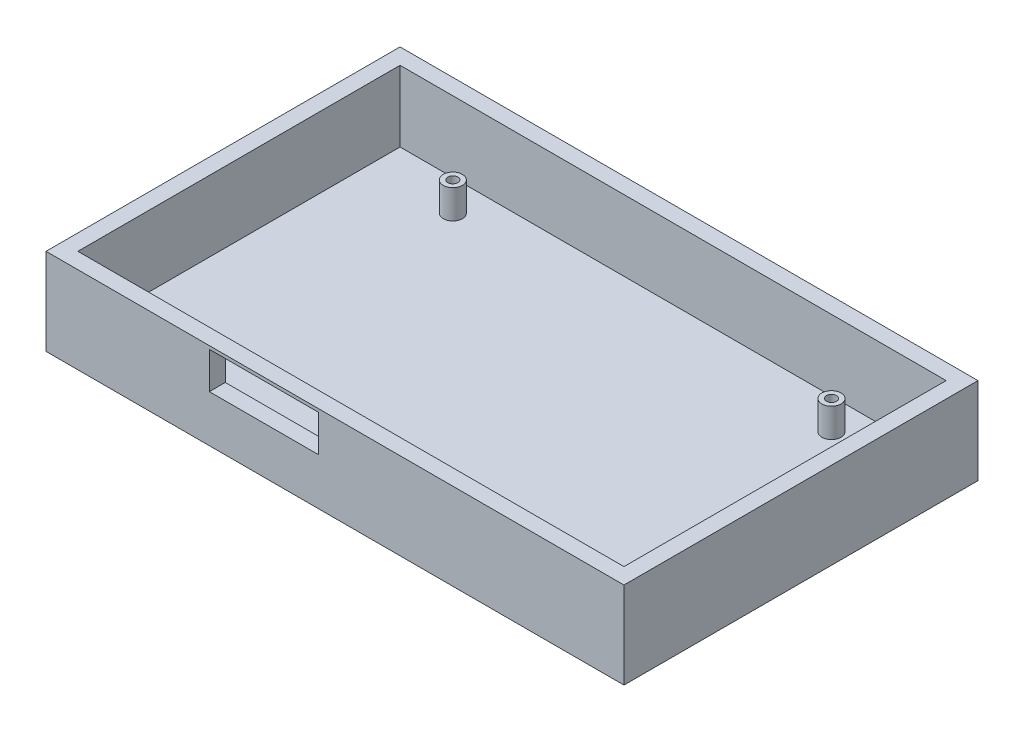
from build123d import *

# Parameters (mm, degrees)
SKETCH1_W                       = 127
SKETCH1_H                       = 77.796898
BOSS_EXTRUDE1_DEPTH             = 19.05
SHELL1_T                        = -3.5
SKETCH2_R                       = 2.1
BOSS_EXTRUDE2_DEPTH             = 6.35
F_44_0_086_DIAMETER_HOLE1_D     = 2.1844
F_44_0_086_DIAMETER_HOLE1_DEPTH = 3.81
F_44_0_086_DIAMETER_HOLE1_TIP   = 0.656259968
F_44_0_086_DIAMETER_HOLE2_D     = 2.1844
F_44_0_086_DIAMETER_HOLE2_DEPTH = 3.81
F_44_0_086_DIAMETER_HOLE2_TIP   = 0.656259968
F_44_0_086_DIAMETER_HOLE3_D     = 2.1844
F_44_0_086_DIAMETER_HOLE3_DEPTH = 3.81
F_44_0_086_DIAMETER_HOLE3_TIP   = 0.656259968
F_44_0_086_DIAMETER_HOLE4_D     = 2.1844
F_44_0_086_DIAMETER_HOLE4_DEPTH = 3.81
F_44_0_086_DIAMETER_HOLE4_TIP   = 0.656259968
CUT_EXTRUDE1_DEPTH              = 2.5
CUT_EXTRUDE2_REACH              = 113.922
SKETCH10_W                      = 24
SKETCH10_H                      = 8.062185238


with BuildPart() as part:
    # Sketch1 → Boss-Extrude1 (new body)
    with BuildSketch(Plane(origin=(0, 0, 0), x_dir=(1, 0, 0), z_dir=(0, 1, 0))):
        with Locations((14.675103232, -10.655753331)):
            Rectangle(SKETCH1_W, SKETCH1_H)
    extrude(amount=BOSS_EXTRUDE1_DEPTH)

    # Shell1
    shell1_openings = [part.faces().sort_by_distance(p)[0] for p in [
        (14.675103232, 19.05, 10.655753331),
    ]]
    offset(amount=SHELL1_T, openings=shell1_openings, kind=Kind.INTERSECTION)

    # Sketch2 → Boss-Extrude2 (add)
    with BuildSketch(Plane(origin=(0, 3.5, 0), x_dir=(1, 0, 0), z_dir=(0, 1, 0))):
        with Locations(Location((56.275203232, -39.257604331, 0), (0, 0, 270))):
            Circle(SKETCH2_R)
        with Locations(Location((-26.924996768, -39.257604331, 0), (0, 0, 270))):
            Circle(SKETCH2_R)
        with Locations(Location((-26.924996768, 17.942695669, 0), (0, 0, 270))):
            Circle(SKETCH2_R)
        with Locations(Location((56.275203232, 17.942695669, 0), (0, 0, 270))):
            Circle(SKETCH2_R)
    extrude(amount=BOSS_EXTRUDE2_DEPTH)

    # 44 _0.086_ Diameter Hole1
    with Locations(Plane(origin=(56.275203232, 9.85, 39.257604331), x_dir=(0, 0, 1), z_dir=(0, 1, 0))):
        with Locations((0, 0)):
            Hole(F_44_0_086_DIAMETER_HOLE1_D / 2, depth=F_44_0_086_DIAMETER_HOLE1_DEPTH)
            with Locations((0, 0, -(F_44_0_086_DIAMETER_HOLE1_DEPTH + F_44_0_086_DIAMETER_HOLE1_TIP / 2))):  # 118° drill point
                Cone(0, F_44_0_086_DIAMETER_HOLE1_D / 2, F_44_0_086_DIAMETER_HOLE1_TIP, mode=Mode.SUBTRACT)

    # 44 _0.086_ Diameter Hole2
    with Locations(Plane(origin=(-26.924996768, 9.85, 39.257604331), x_dir=(0, 0, 1), z_dir=(0, 1, 0))):
        with Locations((0, 0)):
            Hole(F_44_0_086_DIAMETER_HOLE2_D / 2, depth=F_44_0_086_DIAMETER_HOLE2_DEPTH)
            with Locations((0, 0, -(F_44_0_086_DIAMETER_HOLE2_DEPTH + F_44_0_086_DIAMETER_HOLE2_TIP / 2))):  # 118° drill point
                Cone(0, F_44_0_086_DIAMETER_HOLE2_D / 2, F_44_0_086_DIAMETER_HOLE2_TIP, mode=Mode.SUBTRACT)

    # 44 _0.086_ Diameter Hole3
    with Locations(Plane(origin=(-26.924996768, 9.85, -17.942695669), x_dir=(0, 0, 1), z_dir=(0, 1, 0))):
        with Locations((0, 0)):
            Hole(F_44_0_086_DIAMETER_HOLE3_D / 2, depth=F_44_0_086_DIAMETER_HOLE3_DEPTH)
            with Locations((0, 0, -(F_44_0_086_DIAMETER_HOLE3_DEPTH + F_44_0_086_DIAMETER_HOLE3_TIP / 2))):  # 118° drill point
                Cone(0, F_44_0_086_DIAMETER_HOLE3_D / 2, F_44_0_086_DIAMETER_HOLE3_TIP, mode=Mode.SUBTRACT)

    # 44 _0.086_ Diameter Hole4
    with Locations(Plane(origin=(56.275203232, 9.85, -17.942695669), x_dir=(0, 0, 1), z_dir=(0, 1, 0))):
        with Locations((0, 0)):
            Hole(F_44_0_086_DIAMETER_HOLE4_D / 2, depth=F_44_0_086_DIAMETER_HOLE4_DEPTH)
            with Locations((0, 0, -(F_44_0_086_DIAMETER_HOLE4_DEPTH + F_44_0_086_DIAMETER_HOLE4_TIP / 2))):  # 118° drill point
                Cone(0, F_44_0_086_DIAMETER_HOLE4_D / 2, F_44_0_086_DIAMETER_HOLE4_TIP, mode=Mode.SUBTRACT)

    # Sketch9 → Cut-Extrude1 (cut)
    # profile 1 of 5: a face of its own
    with BuildSketch(Plane(origin=(0, 0, -28.242695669), x_dir=(-1, 0, 0), z_dir=(0, 0, -1))):
        with BuildLine():
            Line((-35.805039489, 9.473008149), (-35.814989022, 6.281695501))
            add(Edge.make_bspline(
                [(-35.814989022, 6.281695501), (-35.813887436, 6.20125514), (-35.811785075, 6.047735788), (-35.800085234, 5.828527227), (-35.778566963, 5.631483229), (-35.745920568, 5.457176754), (-35.707732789, 5.304109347), (-35.657647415, 5.173027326), (-35.599752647, 5.063041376), (-35.507144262, 4.946919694), (-35.36246251, 4.834936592), (-35.157229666, 4.73709132), (-34.914264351, 4.678218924), (-34.740768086, 4.666278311), (-34.6484063, 4.659921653)],
                knots=[0, 0, 0, 0, 1.248845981, 2.383405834, 3.406868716, 4.323312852, 5.135063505, 5.852206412, 6.49734745, 7.056204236, 8.145768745, 9.302957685, 10.564213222, 12, 12, 12, 12], degree=3))
            add(Edge.make_bspline(
                [(-34.6484063, 4.659921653), (-34.58950733, 4.657985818), (-34.483184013, 4.654491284), (-34.341972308, 4.6426552), (-34.235504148, 4.62729189), (-34.142843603, 4.598888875), (-34.062193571, 4.520722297), (-34.056814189, 4.439780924), (-34.053921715, 4.396259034)],
                knots=[0, 0, 0, 0, 1.443279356, 2.60538082, 3.470156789, 4.074009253, 4.964401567, 6, 6, 6, 6], degree=3))
            add(Edge.make_bspline(
                [(-34.053921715, 4.396259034), (-34.06077801, 4.362015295), (-34.075636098, 4.287806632), (-34.199104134, 4.225033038), (-34.360995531, 4.184574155), (-34.492592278, 4.183161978), (-34.568810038, 4.182344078)],
                knots=[0, 0, 0, 0, 0.657343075, 1.424510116, 2.50833647, 4, 4, 4, 4], degree=3))
            add(Edge.make_bspline(
                [(-34.568810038, 4.182344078), (-34.591206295, 4.182023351), (-34.642682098, 4.181286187), (-34.728775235, 4.188576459), (-34.835115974, 4.191377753), (-34.9600675, 4.203577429), (-35.104497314, 4.212020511), (-35.267780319, 4.225282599), (-35.450223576, 4.239770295), (-35.578695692, 4.251062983), (-35.645846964, 4.256965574)],
                knots=[0, 0, 0, 0, 0.497540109, 1.143551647, 1.918379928, 2.861064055, 3.932392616, 5.133712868, 6.501816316, 8, 8, 8, 8], degree=3))
            add(Edge.make_bspline(
                [(-35.645846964, 4.256965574), (-35.737045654, 4.263669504), (-35.912786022, 4.276588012), (-36.16567342, 4.294034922), (-36.397018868, 4.308553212), (-36.606678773, 4.322631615), (-36.795067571, 4.327835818), (-36.962412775, 4.337755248), (-37.108440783, 4.338554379), (-37.198806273, 4.340598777), (-37.240259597, 4.341536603)],
                knots=[0, 0, 0, 0, 1.374299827, 2.648283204, 3.80953981, 4.858093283, 5.805845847, 6.641550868, 7.376839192, 8, 8, 8, 8], degree=3))
            add(Edge.make_bspline(
                [(-37.240259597, 4.341536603), (-37.330647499, 4.340378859), (-37.52727766, 4.337860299), (-37.845828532, 4.322253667), (-38.21142069, 4.293931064), (-38.470718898, 4.269781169), (-38.608320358, 4.256965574)],
                knots=[0, 0, 0, 0, 0.791068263, 1.720892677, 2.790548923, 4, 4, 4, 4], degree=3))
            add(Edge.make_bspline(
                [(-38.608320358, 4.256965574), (-38.720206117, 4.245633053), (-38.928075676, 4.224578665), (-39.215961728, 4.203411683), (-39.454662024, 4.186127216), (-39.597448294, 4.183502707), (-39.660483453, 4.182344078)],
                knots=[0, 0, 0, 0, 1.278913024, 2.376058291, 3.283086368, 4, 4, 4, 4], degree=3))
            add(Edge.make_bspline(
                [(-39.660483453, 4.182344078), (-39.702446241, 4.18442148), (-39.776831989, 4.188104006), (-39.874829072, 4.23173888), (-39.937641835, 4.312708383), (-39.941818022, 4.378555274), (-39.944045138, 4.413670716)],
                knots=[0, 0, 0, 0, 1.204302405, 2.134818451, 3.005318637, 4, 4, 4, 4], degree=3))
            add(Edge.make_bspline(
                [(-39.944045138, 4.413670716), (-39.935409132, 4.444090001), (-39.915438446, 4.514434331), (-39.790932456, 4.578090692), (-39.623451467, 4.629654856), (-39.485576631, 4.64891371), (-39.406770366, 4.659921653)],
                knots=[0, 0, 0, 0, 0.583987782, 1.350466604, 2.48558421, 4, 4, 4, 4], degree=3))
            add(Edge.make_bspline(
                [(-39.406770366, 4.659921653), (-39.322658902, 4.67126849), (-39.167124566, 4.692250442), (-38.95620942, 4.74877847), (-38.781962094, 4.81011664), (-38.640269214, 4.891809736), (-38.532375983, 5.004601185), (-38.437206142, 5.140412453), (-38.36921363, 5.314265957), (-38.317566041, 5.482692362), (-38.285539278, 5.654033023), (-38.268718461, 5.831362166), (-38.24692892, 6.053320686), (-38.234198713, 6.321428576), (-38.221655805, 6.634828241), (-38.211181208, 6.993027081), (-38.208068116, 7.396876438), (-38.200384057, 7.986359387), (-38.197790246, 8.72845055), (-38.195747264, 9.587427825), (-38.192297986, 10.390021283), (-38.192722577, 10.905740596), (-38.192927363, 11.154479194)],
                knots=[0, 0, 0, 0, 0.7101107, 1.313098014, 1.825135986, 2.255060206, 2.66752491, 3.122091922, 3.635446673, 4.222098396, 4.596635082, 5.092793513, 5.713319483, 6.464450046, 7.340108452, 8.340459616, 9.465506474, 10.722484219, 13.277989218, 15.680694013, 17.916738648, 20, 20, 20, 20], degree=3))
            Line((-38.192927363, 11.154479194), (-38.202876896, 13.81597922))
            add(Edge.make_bspline(
                [(-38.202876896, 13.81597922), (-38.206476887, 13.902552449), (-38.213349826, 14.067834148), (-38.271644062, 14.303004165), (-38.369346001, 14.509631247), (-38.506799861, 14.691693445), (-38.698544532, 14.838252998), (-38.948861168, 14.938098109), (-39.253786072, 14.999075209), (-39.476084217, 15.004509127), (-39.595811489, 15.007435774)],
                knots=[0, 0, 0, 0, 0.987707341, 1.885686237, 2.745509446, 3.582664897, 4.467162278, 5.464356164, 6.634330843, 8, 8, 8, 8], degree=3))
            add(Edge.make_bspline(
                [(-39.595811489, 15.007435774), (-39.646576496, 15.010147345), (-39.736117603, 15.014930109), (-39.854927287, 15.049991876), (-39.931944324, 15.128353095), (-39.939982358, 15.193431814), (-39.944045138, 15.226325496)],
                knots=[0, 0, 0, 0, 1.322607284, 2.332861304, 3.157353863, 4, 4, 4, 4], degree=3))
            add(Edge.make_bspline(
                [(-39.944045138, 15.226325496), (-39.942736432, 15.246420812), (-39.940120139, 15.286594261), (-39.915044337, 15.343219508), (-39.867751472, 15.386821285), (-39.808307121, 15.424457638), (-39.730417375, 15.449971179), (-39.638659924, 15.474283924), (-39.528687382, 15.480712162), (-39.450684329, 15.483521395), (-39.409257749, 15.485013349)],
                knots=[0, 0, 0, 0, 0.73030502, 1.45998558, 2.185908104, 3.040468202, 4.005272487, 5.155040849, 6.489072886, 8, 8, 8, 8], degree=3))
            Line((-39.409257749, 15.485013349), (-39.185393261, 15.445215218))
            add(Edge.make_bspline(
                [(-39.185393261, 15.445215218), (-39.101875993, 15.426577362), (-38.929281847, 15.388060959), (-38.658044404, 15.352807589), (-38.367456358, 15.329575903), (-38.167275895, 15.327102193), (-38.063583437, 15.325820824)],
                knots=[0, 0, 0, 0, 0.907755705, 1.875939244, 2.899747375, 4, 4, 4, 4], degree=3))
            Line((-38.063583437, 15.325820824), (-34.543936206, 15.485013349))
            add(Edge.make_bspline(
                [(-34.543936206, 15.485013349), (-34.329120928, 15.482939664), (-33.916553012, 15.478957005), (-33.323251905, 15.440183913), (-32.779575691, 15.383956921), (-32.287126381, 15.296528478), (-31.84390571, 15.189162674), (-31.451256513, 15.05542649), (-31.107189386, 14.898533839), (-30.814708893, 14.710561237), (-30.562661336, 14.505056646), (-30.346646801, 14.279136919), (-30.163533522, 14.033637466), (-30.013308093, 13.76898659), (-29.898140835, 13.484409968), (-29.81643893, 13.181256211), (-29.765597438, 12.858379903), (-29.759068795, 12.636321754), (-29.755723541, 12.522539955)],
                knots=[0, 0, 0, 0, 1.613958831, 3.099721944, 4.466142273, 5.718874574, 6.855207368, 7.889612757, 8.831713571, 9.688968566, 10.494684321, 11.270255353, 12.031607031, 12.790481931, 13.550608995, 14.332013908, 15.145329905, 16, 16, 16, 16], degree=3))
            add(Edge.make_bspline(
                [(-29.755723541, 12.522539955), (-29.759220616, 12.408792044), (-29.76607075, 12.185980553), (-29.815371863, 11.859803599), (-29.903965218, 11.552460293), (-30.023062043, 11.260997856), (-30.179207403, 10.98875374), (-30.367639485, 10.731668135), (-30.592195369, 10.493686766), (-30.851068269, 10.272993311), (-31.146533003, 10.071003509), (-31.487767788, 9.900756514), (-31.871677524, 9.757117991), (-32.297765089, 9.638320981), (-32.767169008, 9.54821895), (-33.278733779, 9.48130138), (-33.833574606, 9.441717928), (-34.218023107, 9.43775124), (-34.417079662, 9.435697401)],
                knots=[0, 0, 0, 0, 0.864288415, 1.692983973, 2.498703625, 3.289655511, 4.079728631, 4.877402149, 5.706480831, 6.560024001, 7.458231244, 8.419066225, 9.449975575, 10.568993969, 11.776201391, 13.078949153, 14.487562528, 16, 16, 16, 16], degree=3))
            add(Edge.make_bspline(
                [(-34.417079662, 9.435697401), (-34.517409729, 9.436174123), (-34.728873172, 9.437178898), (-35.060491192, 9.446122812), (-35.422945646, 9.454338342), (-35.674058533, 9.466608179), (-35.805039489, 9.473008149)],
                knots=[0, 0, 0, 0, 0.867028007, 1.827415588, 2.866775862, 4, 4, 4, 4], degree=3))
        make_face()
        with BuildLine():
            add(Edge.make_bspline(
                [(-35.805039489, 10.114753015), (-35.731241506, 10.1090364), (-35.591951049, 10.098246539), (-35.397304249, 10.081858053), (-35.228857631, 10.074371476), (-35.125988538, 10.073066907), (-35.078723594, 10.072467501)],
                knots=[0, 0, 0, 0, 1.220526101, 2.303689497, 3.220601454, 4, 4, 4, 4], degree=3))
            add(Edge.make_bspline(
                [(-35.078723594, 10.072467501), (-34.972473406, 10.074657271), (-34.766737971, 10.078897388), (-34.467822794, 10.117277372), (-34.189244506, 10.17821005), (-33.930942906, 10.264895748), (-33.695560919, 10.378401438), (-33.478262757, 10.512730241), (-33.283611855, 10.676281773), (-33.109907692, 10.862463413), (-32.96006579, 11.067977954), (-32.824730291, 11.28040682), (-32.71188544, 11.504656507), (-32.619614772, 11.737609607), (-32.550934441, 11.981417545), (-32.497507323, 12.232056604), (-32.467575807, 12.493621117), (-32.463881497, 12.670881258), (-32.461996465, 12.761328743)],
                knots=[0, 0, 0, 0, 1.2029, 2.329211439, 3.406829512, 4.42836686, 5.407007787, 6.360593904, 7.3140413, 8.2774255, 9.237141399, 10.190727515, 11.12723811, 12.075863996, 13.023931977, 13.992656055, 14.97574711, 16, 16, 16, 16], degree=3))
            add(Edge.make_bspline(
                [(-32.461996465, 12.761328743), (-32.464034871, 12.845964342), (-32.467983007, 13.009892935), (-32.49466316, 13.24740806), (-32.542600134, 13.467848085), (-32.606719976, 13.673378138), (-32.69020936, 13.863084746), (-32.796922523, 14.033877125), (-32.919395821, 14.189183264), (-33.058563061, 14.32904003), (-33.213728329, 14.448905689), (-33.375249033, 14.558138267), (-33.548229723, 14.646170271), (-33.727414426, 14.723603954), (-33.918178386, 14.775381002), (-34.11524196, 14.819717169), (-34.32192623, 14.844495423), (-34.46262201, 14.846981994), (-34.533986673, 14.848243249)],
                knots=[0, 0, 0, 0, 1.221090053, 2.365099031, 3.442036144, 4.471070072, 5.467032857, 6.42311738, 7.368440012, 8.315803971, 9.261126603, 10.193417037, 11.124401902, 12.057459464, 13.00391671, 13.970569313, 14.970618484, 16, 16, 16, 16], degree=3))
            add(Edge.make_bspline(
                [(-34.533986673, 14.848243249), (-34.616934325, 14.845615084), (-34.798858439, 14.839850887), (-35.094485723, 14.814271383), (-35.435227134, 14.768197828), (-35.676636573, 14.727897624), (-35.805039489, 14.706462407)],
                knots=[0, 0, 0, 0, 0.77780343, 1.705909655, 2.779799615, 4, 4, 4, 4], degree=3))
            Line((-35.805039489, 14.706462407), (-35.805039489, 10.114753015))
        make_face(mode=Mode.SUBTRACT)
    # profile 2 of 5: a face of its own
    with BuildSketch(Plane(origin=(0, 0, -28.242695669), x_dir=(-1, 0, 0), z_dir=(0, 0, -1))):
        with BuildLine():
            add(Edge.make_bspline(
                [(-28.310553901, 15.485013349), (-28.2807085, 15.484089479), (-28.214390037, 15.482036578), (-28.104828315, 15.480964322), (-27.975559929, 15.472013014), (-27.825476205, 15.462387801), (-27.654693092, 15.449648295), (-27.463007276, 15.435671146), (-27.251059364, 15.41389769), (-27.102540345, 15.401811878), (-27.024576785, 15.395467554)],
                knots=[0, 0, 0, 0, 0.555796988, 1.235017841, 2.038860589, 2.966887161, 4.034546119, 5.226477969, 6.544067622, 8, 8, 8, 8], degree=3))
            add(Edge.make_bspline(
                [(-27.024576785, 15.395467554), (-26.90686203, 15.385271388), (-26.684801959, 15.366037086), (-26.370636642, 15.342574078), (-26.094398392, 15.329908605), (-25.922675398, 15.327115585), (-25.843069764, 15.325820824)],
                knots=[0, 0, 0, 0, 1.197629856, 2.259239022, 3.193035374, 4, 4, 4, 4], degree=3))
            Line((-25.843069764, 15.325820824), (-23.099486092, 15.485013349))
            add(Edge.make_bspline(
                [(-23.099486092, 15.485013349), (-23.04870561, 15.482555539), (-22.958846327, 15.478206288), (-22.838711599, 15.439966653), (-22.762697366, 15.355227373), (-22.755137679, 15.28651398), (-22.751252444, 15.251199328)],
                knots=[0, 0, 0, 0, 1.289462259, 2.281785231, 3.116938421, 4, 4, 4, 4], degree=3))
            add(Edge.make_bspline(
                [(-22.751252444, 15.251199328), (-22.754578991, 15.218393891), (-22.761009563, 15.154977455), (-22.830686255, 15.076715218), (-22.934716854, 15.025561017), (-23.018343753, 15.013896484), (-23.064662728, 15.007435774)],
                knots=[0, 0, 0, 0, 0.880891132, 1.702857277, 2.727666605, 4, 4, 4, 4], degree=3))
            add(Edge.make_bspline(
                [(-23.064662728, 15.007435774), (-23.172679, 14.995979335), (-23.36997338, 14.975053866), (-23.636365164, 14.921723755), (-23.845473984, 14.854452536), (-24.012307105, 14.768417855), (-24.133083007, 14.630206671), (-24.228530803, 14.443919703), (-24.309648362, 14.200253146), (-24.36953558, 13.954028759), (-24.406315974, 13.707914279), (-24.433721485, 13.464911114), (-24.454924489, 13.170319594), (-24.471369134, 12.822779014), (-24.48668544, 12.423974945), (-24.496163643, 11.972870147), (-24.500413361, 11.470385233), (-24.501696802, 11.117998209), (-24.502370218, 10.933102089)],
                knots=[0, 0, 0, 0, 1.062370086, 1.940445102, 2.650922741, 3.210279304, 3.749881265, 4.414032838, 5.247718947, 6.256928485, 6.88900471, 7.680802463, 8.648753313, 9.777593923, 11.08435161, 12.552778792, 14.191256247, 16, 16, 16, 16], degree=3))
            add(Edge.make_bspline(
                [(-24.502370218, 10.933102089), (-24.501425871, 10.716700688), (-24.499591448, 10.296334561), (-24.498820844, 9.685239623), (-24.490440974, 9.112314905), (-24.480849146, 8.577514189), (-24.468462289, 8.080024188), (-24.453760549, 7.619834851), (-24.436352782, 7.197793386), (-24.417404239, 6.813769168), (-24.392530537, 6.466277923), (-24.363254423, 6.154376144), (-24.329391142, 5.87618452), (-24.287760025, 5.633794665), (-24.240664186, 5.42527991), (-24.190205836, 5.251711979), (-24.133996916, 5.111093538), (-24.049351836, 4.97203218), (-23.910444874, 4.84094985), (-23.704411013, 4.732018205), (-23.454294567, 4.672036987), (-23.274748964, 4.664133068), (-23.179082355, 4.659921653)],
                knots=[0, 0, 0, 0, 1.864513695, 3.621873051, 5.265058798, 6.801215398, 8.230397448, 9.552672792, 10.76812718, 11.869737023, 12.865274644, 13.769450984, 14.56868141, 15.279217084, 15.887479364, 16.409554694, 16.835428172, 17.188299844, 17.80464653, 18.453463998, 19.175965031, 20, 20, 20, 20], degree=3))
            add(Edge.make_bspline(
                [(-23.179082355, 4.659921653), (-23.116598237, 4.657998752), (-23.00752555, 4.654642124), (-22.867777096, 4.623526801), (-22.768624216, 4.554557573), (-22.756864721, 4.487811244), (-22.751252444, 4.45595623)],
                knots=[0, 0, 0, 0, 1.431161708, 2.498245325, 3.283280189, 4, 4, 4, 4], degree=3))
            add(Edge.make_bspline(
                [(-22.751252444, 4.45595623), (-22.756542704, 4.413947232), (-22.767050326, 4.330508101), (-22.874538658, 4.236736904), (-23.029881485, 4.189049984), (-23.150426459, 4.184772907), (-23.218880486, 4.182344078)],
                knots=[0, 0, 0, 0, 0.813781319, 1.616349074, 2.646393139, 4, 4, 4, 4], degree=3))
            add(Edge.make_bspline(
                [(-23.218880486, 4.182344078), (-23.272783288, 4.182852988), (-23.402213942, 4.184074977), (-23.531480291, 4.190835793), (-23.606912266, 4.194780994)],
                knots=[0, 0, 0, 0, 0.832921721, 2, 2, 2, 2], degree=3))
            add(Edge.make_bspline(
                [(-23.606912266, 4.194780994), (-23.739557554, 4.206569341), (-23.994010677, 4.229182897), (-24.358855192, 4.258729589), (-24.69128612, 4.284494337), (-24.990759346, 4.302792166), (-25.257513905, 4.322732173), (-25.491518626, 4.330758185), (-25.692932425, 4.339875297), (-25.816529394, 4.341016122), (-25.872918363, 4.341536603)],
                knots=[0, 0, 0, 0, 1.407148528, 2.699329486, 3.867858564, 4.930278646, 5.869731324, 6.694029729, 7.40417376, 8, 8, 8, 8], degree=3))
            add(Edge.make_bspline(
                [(-25.872918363, 4.341536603), (-25.979878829, 4.340927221), (-26.187177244, 4.339746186), (-26.487322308, 4.334450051), (-26.76601379, 4.328225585), (-27.022167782, 4.314819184), (-27.257011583, 4.301173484), (-27.470036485, 4.280637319), (-27.661748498, 4.259155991), (-27.781619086, 4.240744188), (-27.837951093, 4.232091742)],
                knots=[0, 0, 0, 0, 1.303069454, 2.525458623, 3.657177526, 4.698806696, 5.650233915, 6.522671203, 7.305743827, 8, 8, 8, 8], degree=3))
            add(Edge.make_bspline(
                [(-27.837951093, 4.232091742), (-27.890139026, 4.224245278), (-27.985252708, 4.209944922), (-28.117245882, 4.195485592), (-28.224123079, 4.183938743), (-28.28814711, 4.182821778), (-28.315528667, 4.182344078)],
                knots=[0, 0, 0, 0, 1.317718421, 2.401571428, 3.316390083, 4, 4, 4, 4], degree=3))
            add(Edge.make_bspline(
                [(-28.315528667, 4.182344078), (-28.363332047, 4.184078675), (-28.44882479, 4.187180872), (-28.560297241, 4.23465836), (-28.633230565, 4.320922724), (-28.638577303, 4.391600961), (-28.641375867, 4.428595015)],
                knots=[0, 0, 0, 0, 1.232142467, 2.203593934, 3.059734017, 4, 4, 4, 4], degree=3))
            add(Edge.make_bspline(
                [(-28.641375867, 4.428595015), (-28.638411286, 4.458615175), (-28.632489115, 4.51858472), (-28.569292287, 4.594568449), (-28.470085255, 4.640363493), (-28.393156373, 4.652929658), (-28.350352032, 4.659921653)],
                knots=[0, 0, 0, 0, 0.864930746, 1.727822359, 2.735727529, 4, 4, 4, 4], degree=3))
            add(Edge.make_bspline(
                [(-28.350352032, 4.659921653), (-28.227908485, 4.67678831), (-28.001917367, 4.707918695), (-27.698171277, 4.79358853), (-27.455888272, 4.90373926), (-27.297438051, 5.027406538), (-27.20666721, 5.154816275), (-27.148983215, 5.274525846), (-27.096852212, 5.420475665), (-27.053053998, 5.592966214), (-27.016459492, 5.791628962), (-26.987526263, 6.017593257), (-26.962476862, 6.269695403), (-26.945713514, 6.55183381), (-26.934717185, 6.86704732), (-26.921297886, 7.221031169), (-26.911763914, 7.615729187), (-26.905138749, 8.051052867), (-26.896810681, 8.526950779), (-26.892290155, 9.043511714), (-26.88969078, 9.600691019), (-26.890064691, 9.985408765), (-26.890258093, 10.184399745)],
                knots=[0, 0, 0, 0, 1.167343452, 2.1545378, 2.971315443, 3.672746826, 4.020781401, 4.441377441, 4.924821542, 5.483696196, 6.121609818, 6.833213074, 7.636454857, 8.515950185, 9.504232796, 10.617825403, 11.864357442, 13.23609424, 14.73321167, 16.363454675, 18.119037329, 20, 20, 20, 20], degree=3))
            add(Edge.make_bspline(
                [(-26.890258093, 10.184399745), (-26.89085597, 10.392512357), (-26.891999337, 10.790502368), (-26.897274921, 11.360944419), (-26.90352931, 11.877544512), (-26.916415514, 12.340199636), (-26.931282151, 12.748974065), (-26.947281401, 13.104016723), (-26.969599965, 13.405045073), (-26.994766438, 13.657156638), (-27.022276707, 13.87212561), (-27.054463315, 14.06135162), (-27.090655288, 14.230215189), (-27.13331344, 14.376906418), (-27.176650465, 14.502610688), (-27.226670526, 14.606199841), (-27.280854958, 14.690040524), (-27.364308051, 14.777574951), (-27.506132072, 14.857401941), (-27.71454155, 14.93048673), (-27.978891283, 14.979339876), (-28.172749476, 14.997536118), (-28.278217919, 15.007435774)],
                knots=[0, 0, 0, 0, 2.219542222, 4.24460405, 6.084082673, 7.729424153, 9.180601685, 10.446625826, 11.519551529, 12.399436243, 13.148567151, 13.830375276, 14.446136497, 14.989082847, 15.458997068, 15.862384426, 16.213096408, 16.519545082, 17.142878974, 17.923296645, 18.870170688, 20, 20, 20, 20], degree=3))
            add(Edge.make_bspline(
                [(-28.278217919, 15.007435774), (-28.332038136, 15.012591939), (-28.42711788, 15.02170091), (-28.547242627, 15.074203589), (-28.630834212, 15.157690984), (-28.6378295, 15.229645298), (-28.641375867, 15.266123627)],
                knots=[0, 0, 0, 0, 1.300981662, 2.298337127, 3.137316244, 4, 4, 4, 4], degree=3))
            add(Edge.make_bspline(
                [(-28.641375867, 15.266123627), (-28.638591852, 15.300055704), (-28.633234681, 15.36534988), (-28.556664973, 15.441045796), (-28.445397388, 15.481629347), (-28.359088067, 15.483795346), (-28.310553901, 15.485013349)],
                knots=[0, 0, 0, 0, 0.884054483, 1.701151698, 2.707292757, 4, 4, 4, 4], degree=3))
        make_face()
    # profile 3 of 5: a face of its own
    with BuildSketch(Plane(origin=(0, 0, -28.242695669), x_dir=(-1, 0, 0), z_dir=(0, 0, -1))):
        with BuildLine():
            add(Edge.make_bspline(
                [(-15.505505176, 11.428091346), (-15.374947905, 11.601919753), (-15.128158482, 11.930503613), (-14.78499626, 12.3995279), (-14.498505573, 12.822288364), (-14.2645081, 13.195896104), (-14.076219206, 13.517116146), (-13.947909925, 13.792212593), (-13.856401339, 14.015179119), (-13.842418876, 14.152892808), (-13.836471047, 14.211473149)],
                knots=[0, 0, 0, 0, 1.594670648, 3.014369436, 4.262637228, 5.339250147, 6.249014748, 6.989007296, 7.56994618, 8, 8, 8, 8], degree=3))
            add(Edge.make_bspline(
                [(-13.836471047, 14.211473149), (-13.838607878, 14.259848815), (-13.842731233, 14.353197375), (-13.881354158, 14.484276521), (-13.941932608, 14.601106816), (-14.034733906, 14.703130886), (-14.166952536, 14.791962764), (-14.343537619, 14.872259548), (-14.570091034, 14.945586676), (-14.739038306, 14.985571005), (-14.831424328, 15.007435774)],
                knots=[0, 0, 0, 0, 0.82647252, 1.594810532, 2.318850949, 3.062799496, 3.929273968, 5.027950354, 6.374783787, 8, 8, 8, 8], degree=3))
            add(Edge.make_bspline(
                [(-14.831424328, 15.007435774), (-14.872859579, 15.016703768), (-14.947907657, 15.033490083), (-15.04162383, 15.089099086), (-15.101433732, 15.170489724), (-15.107101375, 15.233680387), (-15.110011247, 15.266123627)],
                knots=[0, 0, 0, 0, 1.216538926, 2.20341147, 3.077598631, 4, 4, 4, 4], degree=3))
            add(Edge.make_bspline(
                [(-15.110011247, 15.266123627), (-15.107227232, 15.300055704), (-15.101870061, 15.36534988), (-15.025300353, 15.441045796), (-14.914032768, 15.481629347), (-14.827723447, 15.483795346), (-14.779189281, 15.485013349)],
                knots=[0, 0, 0, 0, 0.884054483, 1.701151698, 2.707292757, 4, 4, 4, 4], degree=3))
            add(Edge.make_bspline(
                [(-14.779189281, 15.485013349), (-14.740205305, 15.483637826), (-14.650501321, 15.480472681), (-14.498603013, 15.467473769), (-14.313022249, 15.444226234), (-14.178047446, 15.425490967), (-14.105108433, 15.415366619)],
                knots=[0, 0, 0, 0, 0.690280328, 1.588367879, 2.696778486, 4, 4, 4, 4], degree=3))
            add(Edge.make_bspline(
                [(-14.105108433, 15.415366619), (-14.000729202, 15.401281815), (-13.799774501, 15.374165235), (-13.510069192, 15.34832783), (-13.245576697, 15.328455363), (-13.077851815, 15.326668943), (-12.998222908, 15.325820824)],
                knots=[0, 0, 0, 0, 1.137132, 2.189247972, 3.140329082, 4, 4, 4, 4], degree=3))
            add(Edge.make_bspline(
                [(-12.998222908, 15.325820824), (-12.885439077, 15.327625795), (-12.642319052, 15.331516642), (-12.254208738, 15.352941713), (-11.81622451, 15.384820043), (-11.509036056, 15.416190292), (-11.346600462, 15.432778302)],
                knots=[0, 0, 0, 0, 0.817460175, 1.762140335, 2.816661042, 4, 4, 4, 4], degree=3))
            add(Edge.make_bspline(
                [(-11.346600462, 15.432778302), (-11.27446235, 15.440227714), (-11.145122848, 15.453584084), (-10.973641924, 15.471460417), (-10.847616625, 15.48285817), (-10.778659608, 15.484414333), (-10.752115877, 15.485013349)],
                knots=[0, 0, 0, 0, 1.457794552, 2.613742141, 3.466385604, 4, 4, 4, 4], degree=3))
            add(Edge.make_bspline(
                [(-10.752115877, 15.485013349), (-10.690354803, 15.48303254), (-10.582817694, 15.479583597), (-10.443178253, 15.438330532), (-10.346345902, 15.354453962), (-10.338259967, 15.278869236), (-10.334235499, 15.241249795)],
                knots=[0, 0, 0, 0, 1.362435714, 2.372244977, 3.189846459, 4, 4, 4, 4], degree=3))
            add(Edge.make_bspline(
                [(-10.334235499, 15.241249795), (-10.33767029, 15.208597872), (-10.344434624, 15.144294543), (-10.414159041, 15.063464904), (-10.524720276, 15.022301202), (-10.608365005, 15.012764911), (-10.655107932, 15.007435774)],
                knots=[0, 0, 0, 0, 0.872789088, 1.718834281, 2.725223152, 4, 4, 4, 4], degree=3))
            add(Edge.make_bspline(
                [(-10.655107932, 15.007435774), (-10.753330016, 15.000174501), (-10.952789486, 14.985429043), (-11.250802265, 14.91195385), (-11.551584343, 14.802066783), (-11.849965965, 14.64971752), (-12.142394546, 14.463064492), (-12.426227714, 14.245028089), (-12.696055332, 13.992976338), (-12.917031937, 13.752949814), (-13.105803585, 13.520637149), (-13.291245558, 13.298403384), (-13.50888963, 13.019947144), (-13.768261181, 12.69281091), (-14.062972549, 12.312055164), (-14.397260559, 11.881666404), (-14.766909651, 11.399191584), (-15.0262647, 11.060783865), (-15.162246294, 10.883354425)],
                knots=[0, 0, 0, 0, 0.749268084, 1.521537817, 2.328947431, 3.184961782, 4.068211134, 4.969108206, 5.907837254, 6.877987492, 7.452257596, 8.188307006, 9.083137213, 10.144718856, 11.369170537, 12.751529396, 14.296805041, 16, 16, 16, 16], degree=3))
            add(Edge.make_bspline(
                [(-15.162246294, 10.883354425), (-14.986101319, 10.606959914), (-14.627034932, 10.043537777), (-14.070514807, 9.189599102), (-13.486836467, 8.309844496), (-12.989013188, 7.569308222), (-12.587943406, 6.992296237), (-12.30498103, 6.600202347), (-12.043756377, 6.249788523), (-11.80110721, 5.944161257), (-11.576892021, 5.682143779), (-11.374308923, 5.462301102), (-11.190426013, 5.286159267), (-10.977160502, 5.114711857), (-10.728099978, 4.956169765), (-10.448104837, 4.806877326), (-10.184364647, 4.703598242), (-10.010709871, 4.673921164), (-9.928792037, 4.659921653)],
                knots=[0, 0, 0, 0, 1.895452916, 3.863825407, 5.894595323, 8.001204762, 9.024122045, 9.958354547, 10.797485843, 11.55158815, 12.21470886, 12.791470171, 13.279905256, 13.68578742, 14.372064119, 14.98331367, 15.520400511, 16, 16, 16, 16], degree=3))
            add(Edge.make_bspline(
                [(-9.928792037, 4.659921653), (-9.871121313, 4.651171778), (-9.769980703, 4.635826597), (-9.640823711, 4.590416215), (-9.553744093, 4.512650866), (-9.543312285, 4.445911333), (-9.538272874, 4.413670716)],
                knots=[0, 0, 0, 0, 1.387091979, 2.432626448, 3.24283122, 4, 4, 4, 4], degree=3))
            add(Edge.make_bspline(
                [(-9.538272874, 4.413670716), (-9.542539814, 4.377809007), (-9.551025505, 4.30649059), (-9.643279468, 4.225839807), (-9.777524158, 4.189343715), (-9.880438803, 4.184875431), (-9.938741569, 4.182344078)],
                knots=[0, 0, 0, 0, 0.811799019, 1.614430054, 2.648537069, 4, 4, 4, 4], degree=3))
            Line((-9.938741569, 4.182344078), (-13.013147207, 4.341536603))
            add(Edge.make_bspline(
                [(-13.013147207, 4.341536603), (-13.21229014, 4.338433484), (-13.610354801, 4.332230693), (-14.006594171, 4.29365459), (-14.204603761, 4.274377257)],
                knots=[0, 0, 0, 0, 1.0005557, 2, 2, 2, 2], degree=3))
            add(Edge.make_bspline(
                [(-14.204603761, 4.274377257), (-14.283374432, 4.268625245), (-14.425186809, 4.258269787), (-14.615092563, 4.243723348), (-14.758403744, 4.230560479), (-14.838880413, 4.224555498), (-14.871222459, 4.222142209)],
                knots=[0, 0, 0, 0, 1.417394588, 2.55176316, 3.417981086, 4, 4, 4, 4], degree=3))
            add(Edge.make_bspline(
                [(-14.871222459, 4.222142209), (-14.925116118, 4.22234241), (-15.021303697, 4.222699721), (-15.149037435, 4.220633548), (-15.242764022, 4.215998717), (-15.294085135, 4.211463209), (-15.313976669, 4.209705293)],
                knots=[0, 0, 0, 0, 1.459480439, 2.604831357, 3.459247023, 4, 4, 4, 4], degree=3))
            add(Edge.make_bspline(
                [(-15.313976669, 4.209705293), (-15.35033025, 4.202131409), (-15.413619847, 4.188945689), (-15.478073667, 4.184314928), (-15.505505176, 4.182344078)],
                knots=[0, 0, 0, 0, 1.148801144, 2, 2, 2, 2], degree=3))
            add(Edge.make_bspline(
                [(-15.505505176, 4.182344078), (-15.540963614, 4.184331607), (-15.60680984, 4.188022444), (-15.693709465, 4.238738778), (-15.740813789, 4.328938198), (-15.744670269, 4.396555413), (-15.746781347, 4.433569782)],
                knots=[0, 0, 0, 0, 1.061270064, 1.970775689, 2.889181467, 4, 4, 4, 4], degree=3))
            add(Edge.make_bspline(
                [(-15.746781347, 4.433569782), (-15.745067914, 4.467206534), (-15.741871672, 4.529952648), (-15.700815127, 4.612998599), (-15.628878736, 4.667914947), (-15.571097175, 4.678929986), (-15.540328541, 4.684795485)],
                knots=[0, 0, 0, 0, 1.109263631, 2.069224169, 2.971863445, 4, 4, 4, 4], degree=3))
            add(Edge.make_bspline(
                [(-15.540328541, 4.684795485), (-15.487875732, 4.693640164), (-15.388339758, 4.710424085), (-15.249014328, 4.751597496), (-15.130863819, 4.811265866), (-15.033418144, 4.886612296), (-14.95935507, 4.979100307), (-14.906176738, 5.086694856), (-14.873347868, 5.209384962), (-14.870306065, 5.296481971), (-14.868735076, 5.34146465)],
                knots=[0, 0, 0, 0, 1.218915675, 2.31304979, 3.316063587, 4.236244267, 5.11485513, 6.007335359, 6.970855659, 8, 8, 8, 8], degree=3))
            add(Edge.make_bspline(
                [(-14.868735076, 5.34146465), (-14.870712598, 5.37136251), (-14.875138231, 5.43827299), (-14.895028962, 5.547168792), (-14.935455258, 5.672177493), (-14.984202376, 5.815174), (-15.046429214, 5.976099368), (-15.128408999, 6.151839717), (-15.218330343, 6.348118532), (-15.327377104, 6.560254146), (-15.448096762, 6.790114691), (-15.583821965, 7.037737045), (-15.731516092, 7.30314474), (-15.897970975, 7.584087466), (-16.072370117, 7.885206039), (-16.266052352, 8.201490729), (-16.470710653, 8.536750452), (-16.61534464, 8.764329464), (-16.68949958, 8.881010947)],
                knots=[0, 0, 0, 0, 0.35924273, 0.803974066, 1.323091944, 1.933201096, 2.616482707, 3.39094118, 4.258452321, 5.205740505, 6.251095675, 7.372533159, 8.592467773, 9.893829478, 11.288968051, 12.76591807, 14.341861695, 16, 16, 16, 16], degree=3))
            add(Edge.make_bspline(
                [(-16.68949958, 8.881010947), (-16.776685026, 8.766688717), (-16.946830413, 8.543584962), (-17.192197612, 8.217459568), (-17.418596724, 7.907006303), (-17.631707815, 7.616934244), (-17.823402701, 7.340255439), (-18.004493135, 7.085725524), (-18.162803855, 6.845182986), (-18.308015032, 6.624915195), (-18.4338777, 6.421119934), (-18.545603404, 6.236608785), (-18.636251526, 6.066990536), (-18.715410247, 5.91692192), (-18.771824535, 5.781959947), (-18.814994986, 5.666261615), (-18.846010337, 5.56859654), (-18.849508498, 5.50745068), (-18.851035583, 5.48075811)],
                knots=[0, 0, 0, 0, 1.702511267, 3.322509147, 4.832625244, 6.252496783, 7.584478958, 8.818330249, 9.951127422, 10.994120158, 11.942221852, 12.787497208, 13.547565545, 14.219375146, 14.795643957, 15.277134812, 15.684440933, 16, 16, 16, 16], degree=3))
            add(Edge.make_bspline(
                [(-18.851035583, 5.48075811), (-18.847032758, 5.431297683), (-18.839022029, 5.332314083), (-18.778588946, 5.191239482), (-18.677331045, 5.066108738), (-18.53509291, 4.960075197), (-18.358831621, 4.862536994), (-18.143610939, 4.779591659), (-17.890036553, 4.710504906), (-17.707159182, 4.677491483), (-17.609831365, 4.659921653)],
                knots=[0, 0, 0, 0, 0.734774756, 1.470481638, 2.243339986, 3.104906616, 4.09379538, 5.23504318, 6.528482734, 8, 8, 8, 8], degree=3))
            add(Edge.make_bspline(
                [(-17.609831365, 4.659921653), (-17.569363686, 4.652107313), (-17.497039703, 4.638141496), (-17.407268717, 4.591251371), (-17.347670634, 4.522380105), (-17.341746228, 4.4669725), (-17.338706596, 4.438544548)],
                knots=[0, 0, 0, 0, 1.283658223, 2.294158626, 3.12478484, 4, 4, 4, 4], degree=3))
            add(Edge.make_bspline(
                [(-17.338706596, 4.438544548), (-17.340631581, 4.40004651), (-17.344222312, 4.328234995), (-17.410127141, 4.239398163), (-17.512443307, 4.185864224), (-17.592456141, 4.183606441), (-17.63719258, 4.182344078)],
                knots=[0, 0, 0, 0, 1.010077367, 1.884126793, 2.816981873, 4, 4, 4, 4], degree=3))
            add(Edge.make_bspline(
                [(-17.63719258, 4.182344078), (-17.670365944, 4.183857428), (-17.757537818, 4.187834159), (-17.91766555, 4.200678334), (-18.137191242, 4.224307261), (-18.302981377, 4.24205171), (-18.395844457, 4.251990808)],
                knots=[0, 0, 0, 0, 0.522944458, 1.374176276, 2.529212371, 4, 4, 4, 4], degree=3))
            add(Edge.make_bspline(
                [(-18.395844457, 4.251990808), (-18.642699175, 4.27810824), (-19.134689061, 4.330161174), (-19.629364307, 4.337753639), (-19.875837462, 4.341536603)],
                knots=[0, 0, 0, 0, 1.003495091, 2, 2, 2, 2], degree=3))
            add(Edge.make_bspline(
                [(-19.875837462, 4.341536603), (-19.986107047, 4.340093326), (-20.193426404, 4.337379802), (-20.485698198, 4.330342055), (-20.738680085, 4.307379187), (-20.894066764, 4.286457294), (-20.965311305, 4.27686464)],
                knots=[0, 0, 0, 0, 1.211484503, 2.27772861, 3.210341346, 4, 4, 4, 4], degree=3))
            add(Edge.make_bspline(
                [(-20.965311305, 4.27686464), (-21.041446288, 4.261828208), (-21.179267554, 4.23460892), (-21.367464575, 4.210326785), (-21.512763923, 4.185727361), (-21.597045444, 4.183334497), (-21.631930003, 4.182344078)],
                knots=[0, 0, 0, 0, 1.381190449, 2.50026215, 3.379250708, 4, 4, 4, 4], degree=3))
            add(Edge.make_bspline(
                [(-21.631930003, 4.182344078), (-21.703045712, 4.183664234), (-21.826944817, 4.185964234), (-21.98392373, 4.233266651), (-22.098073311, 4.317225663), (-22.109102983, 4.398772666), (-22.114482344, 4.438544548)],
                knots=[0, 0, 0, 0, 1.397208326, 2.434242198, 3.236352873, 4, 4, 4, 4], degree=3))
            add(Edge.make_bspline(
                [(-22.114482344, 4.438544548), (-22.111271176, 4.46762605), (-22.105081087, 4.523685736), (-22.050017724, 4.596058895), (-21.963040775, 4.642988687), (-21.893743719, 4.653929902), (-21.855794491, 4.659921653)],
                knots=[0, 0, 0, 0, 0.918991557, 1.771517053, 2.779613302, 4, 4, 4, 4], degree=3))
            add(Edge.make_bspline(
                [(-21.855794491, 4.659921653), (-21.735948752, 4.678397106), (-21.506711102, 4.713736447), (-21.185987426, 4.799629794), (-20.901891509, 4.899340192), (-20.689910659, 5.005988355), (-20.535490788, 5.112319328), (-20.412157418, 5.203579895), (-20.287333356, 5.316698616), (-20.153594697, 5.444284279), (-20.01542118, 5.591525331), (-19.869557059, 5.754981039), (-19.71617003, 5.934523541), (-19.556286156, 6.141323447), (-19.370519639, 6.380062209), (-19.150856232, 6.663870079), (-18.895972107, 7.001119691), (-18.595980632, 7.385059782), (-18.260707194, 7.823249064), (-17.888383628, 8.313664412), (-17.474502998, 8.853511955), (-17.186095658, 9.230863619), (-17.035245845, 9.428235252)],
                knots=[0, 0, 0, 0, 1.042280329, 1.993645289, 2.850895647, 3.629131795, 4.024714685, 4.462583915, 4.94762281, 5.472155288, 6.052257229, 6.68357596, 7.356538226, 8.082714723, 8.931469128, 9.958487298, 11.169437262, 12.56735202, 14.149185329, 15.914962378, 17.863344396, 20, 20, 20, 20], degree=3))
            add(Edge.make_bspline(
                [(-17.035245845, 9.428235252), (-17.123657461, 9.56855245), (-17.297158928, 9.843914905), (-17.556505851, 10.244033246), (-17.799090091, 10.629439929), (-18.035630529, 10.991933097), (-18.263201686, 11.33466831), (-18.474745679, 11.660983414), (-18.68120795, 11.963881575), (-18.870618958, 12.251665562), (-19.056636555, 12.516178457), (-19.225857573, 12.765521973), (-19.389487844, 12.992171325), (-19.539754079, 13.201376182), (-19.682973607, 13.389558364), (-19.810075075, 13.561909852), (-19.931218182, 13.71149512), (-20.073391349, 13.884772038), (-20.248083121, 14.074497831), (-20.457007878, 14.281072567), (-20.67060456, 14.460164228), (-20.887305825, 14.613411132), (-21.10721105, 14.737507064), (-21.327510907, 14.83959047), (-21.552401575, 14.91250786), (-21.705349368, 14.941050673), (-21.781172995, 14.955200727)],
                knots=[0, 0, 0, 0, 1.601910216, 3.143634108, 4.605496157, 6.000478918, 7.324314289, 8.579308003, 9.756537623, 10.864904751, 11.906786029, 12.879783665, 13.77538165, 14.606767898, 15.367580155, 16.059520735, 16.674877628, 17.226538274, 18.224237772, 19.164347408, 20.062591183, 20.913534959, 21.724101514, 22.498242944, 23.255506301, 24, 24, 24, 24], degree=3))
            add(Edge.make_bspline(
                [(-21.781172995, 14.955200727), (-21.830995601, 14.964963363), (-21.919292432, 14.982264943), (-22.029559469, 15.041006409), (-22.104768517, 15.125006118), (-22.111255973, 15.194334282), (-22.114482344, 15.228812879)],
                knots=[0, 0, 0, 0, 1.282221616, 2.272384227, 3.140814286, 4, 4, 4, 4], degree=3))
            add(Edge.make_bspline(
                [(-22.114482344, 15.228812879), (-22.111677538, 15.26735805), (-22.106418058, 15.33963667), (-22.036959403, 15.429814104), (-21.927585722, 15.480964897), (-21.843157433, 15.483564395), (-21.796097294, 15.485013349)],
                knots=[0, 0, 0, 0, 0.978981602, 1.835753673, 2.79365397, 4, 4, 4, 4], degree=3))
            add(Edge.make_bspline(
                [(-21.796097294, 15.485013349), (-21.732109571, 15.481225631), (-21.58244939, 15.472366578), (-21.435167, 15.444026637), (-21.350855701, 15.427803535)],
                knots=[0, 0, 0, 0, 0.855106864, 2, 2, 2, 2], degree=3))
            add(Edge.make_bspline(
                [(-21.350855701, 15.427803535), (-21.298707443, 15.418861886), (-21.180831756, 15.398650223), (-20.982872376, 15.381640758), (-20.744948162, 15.363810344), (-20.467970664, 15.34891099), (-20.150316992, 15.340000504), (-19.792952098, 15.332511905), (-19.394955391, 15.327645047), (-19.116357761, 15.326447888), (-18.970429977, 15.325820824)],
                knots=[0, 0, 0, 0, 0.532284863, 1.203174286, 1.998050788, 2.933974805, 3.994251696, 5.196120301, 6.531344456, 8, 8, 8, 8], degree=3))
            add(Edge.make_bspline(
                [(-18.970429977, 15.325820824), (-18.836080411, 15.326400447), (-18.554802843, 15.327613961), (-18.11302993, 15.35183183), (-17.631720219, 15.37574129), (-17.298002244, 15.405102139), (-17.124791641, 15.420341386)],
                knots=[0, 0, 0, 0, 0.871977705, 1.825594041, 2.8714118, 4, 4, 4, 4], degree=3))
            add(Edge.make_bspline(
                [(-17.124791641, 15.420341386), (-17.027741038, 15.4289801), (-16.855993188, 15.444267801), (-16.633456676, 15.470000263), (-16.478090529, 15.478745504), (-16.397645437, 15.483351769), (-16.368627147, 15.485013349)],
                knots=[0, 0, 0, 0, 1.540431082, 2.726059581, 3.540462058, 4, 4, 4, 4], degree=3))
            add(Edge.make_bspline(
                [(-16.368627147, 15.485013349), (-16.301166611, 15.482671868), (-16.182472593, 15.478552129), (-16.029802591, 15.44091014), (-15.923873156, 15.358521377), (-15.911865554, 15.283187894), (-15.905973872, 15.246224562)],
                knots=[0, 0, 0, 0, 1.400798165, 2.46464634, 3.246659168, 4, 4, 4, 4], degree=3))
            add(Edge.make_bspline(
                [(-15.905973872, 15.246224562), (-15.909727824, 15.209959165), (-15.917197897, 15.137793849), (-15.999507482, 15.049870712), (-16.125630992, 15.003216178), (-16.22225937, 14.994772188), (-16.276593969, 14.990024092)],
                knots=[0, 0, 0, 0, 0.849837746, 1.691110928, 2.701700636, 4, 4, 4, 4], degree=3))
            add(Edge.make_bspline(
                [(-16.276593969, 14.990024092), (-16.314876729, 14.985874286), (-16.397199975, 14.976950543), (-16.527765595, 14.943849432), (-16.676026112, 14.902669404), (-16.832112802, 14.849247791), (-16.977957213, 14.783634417), (-17.092520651, 14.695429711), (-17.164241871, 14.58192791), (-17.172749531, 14.497621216), (-17.177026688, 14.455236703)],
                knots=[0, 0, 0, 0, 0.815376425, 1.753385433, 2.849500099, 4.077983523, 5.249308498, 6.223824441, 7.107042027, 8, 8, 8, 8], degree=3))
            add(Edge.make_bspline(
                [(-17.177026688, 14.455236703), (-17.171122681, 14.406798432), (-17.156948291, 14.290507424), (-17.084751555, 14.096907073), (-16.974564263, 13.855586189), (-16.847766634, 13.624751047), (-16.724335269, 13.405439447), (-16.607055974, 13.206617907), (-16.469550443, 12.979855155), (-16.313259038, 12.724734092), (-16.138654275, 12.440133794), (-15.945280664, 12.12714709), (-15.730977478, 11.787134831), (-15.582578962, 11.550824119), (-15.505505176, 11.428091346)],
                knots=[0, 0, 0, 0, 0.504323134, 1.210783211, 2.125984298, 3.256137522, 3.937162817, 4.734405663, 5.64803233, 6.685472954, 7.834928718, 9.108227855, 10.498099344, 12, 12, 12, 12], degree=3))
        make_face()
    # profile 4 of 5: a face of its own
    with BuildSketch(Plane(origin=(0, 0, -28.242695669), x_dir=(-1, 0, 0), z_dir=(0, 0, -1))):
        with BuildLine():
            add(Edge.make_bspline(
                [(-8.729873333, 15.485013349), (-8.700027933, 15.484089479), (-8.63370947, 15.482036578), (-8.524147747, 15.480964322), (-8.394879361, 15.472013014), (-8.244795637, 15.462387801), (-8.074012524, 15.449648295), (-7.882326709, 15.435671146), (-7.670378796, 15.41389769), (-7.521859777, 15.401811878), (-7.443896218, 15.395467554)],
                knots=[0, 0, 0, 0, 0.555796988, 1.235017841, 2.038860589, 2.966887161, 4.034546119, 5.226477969, 6.544067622, 8, 8, 8, 8], degree=3))
            add(Edge.make_bspline(
                [(-7.443896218, 15.395467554), (-7.326181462, 15.385271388), (-7.104121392, 15.366037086), (-6.789956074, 15.342574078), (-6.513717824, 15.329908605), (-6.34199483, 15.327115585), (-6.262389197, 15.325820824)],
                knots=[0, 0, 0, 0, 1.197629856, 2.259239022, 3.193035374, 4, 4, 4, 4], degree=3))
            Line((-6.262389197, 15.325820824), (-3.518805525, 15.485013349))
            add(Edge.make_bspline(
                [(-3.518805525, 15.485013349), (-3.468025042, 15.482555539), (-3.378165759, 15.478206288), (-3.258031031, 15.439966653), (-3.182016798, 15.355227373), (-3.174457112, 15.28651398), (-3.170571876, 15.251199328)],
                knots=[0, 0, 0, 0, 1.289462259, 2.281785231, 3.116938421, 4, 4, 4, 4], degree=3))
            add(Edge.make_bspline(
                [(-3.170571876, 15.251199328), (-3.173898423, 15.218393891), (-3.180328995, 15.154977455), (-3.250005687, 15.076715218), (-3.354036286, 15.025561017), (-3.437663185, 15.013896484), (-3.48398216, 15.007435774)],
                knots=[0, 0, 0, 0, 0.880891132, 1.702857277, 2.727666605, 4, 4, 4, 4], degree=3))
            add(Edge.make_bspline(
                [(-3.48398216, 15.007435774), (-3.591998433, 14.995979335), (-3.789292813, 14.975053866), (-4.055684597, 14.921723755), (-4.264793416, 14.854452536), (-4.431626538, 14.768417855), (-4.552402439, 14.630206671), (-4.647850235, 14.443919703), (-4.728967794, 14.200253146), (-4.788855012, 13.954028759), (-4.825635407, 13.707914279), (-4.853040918, 13.464911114), (-4.874243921, 13.170319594), (-4.890688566, 12.822779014), (-4.906004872, 12.423974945), (-4.915483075, 11.972870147), (-4.919732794, 11.470385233), (-4.921016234, 11.117998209), (-4.921689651, 10.933102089)],
                knots=[0, 0, 0, 0, 1.062370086, 1.940445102, 2.650922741, 3.210279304, 3.749881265, 4.414032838, 5.247718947, 6.256928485, 6.88900471, 7.680802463, 8.648753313, 9.777593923, 11.08435161, 12.552778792, 14.191256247, 16, 16, 16, 16], degree=3))
            add(Edge.make_bspline(
                [(-4.921689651, 10.933102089), (-4.920745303, 10.716700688), (-4.91891088, 10.296334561), (-4.918140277, 9.685239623), (-4.909760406, 9.112314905), (-4.900168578, 8.577514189), (-4.887781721, 8.080024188), (-4.873079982, 7.619834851), (-4.855672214, 7.197793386), (-4.836723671, 6.813769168), (-4.811849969, 6.466277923), (-4.782573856, 6.154376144), (-4.748710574, 5.87618452), (-4.707079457, 5.633794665), (-4.659983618, 5.42527991), (-4.609525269, 5.251711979), (-4.553316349, 5.111093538), (-4.468671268, 4.97203218), (-4.329764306, 4.84094985), (-4.123730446, 4.732018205), (-3.873613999, 4.672036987), (-3.694068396, 4.664133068), (-3.598401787, 4.659921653)],
                knots=[0, 0, 0, 0, 1.864513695, 3.621873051, 5.265058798, 6.801215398, 8.230397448, 9.552672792, 10.76812718, 11.869737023, 12.865274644, 13.769450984, 14.56868141, 15.279217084, 15.887479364, 16.409554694, 16.835428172, 17.188299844, 17.80464653, 18.453463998, 19.175965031, 20, 20, 20, 20], degree=3))
            add(Edge.make_bspline(
                [(-3.598401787, 4.659921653), (-3.53591767, 4.657998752), (-3.426844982, 4.654642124), (-3.287096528, 4.623526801), (-3.187943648, 4.554557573), (-3.176184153, 4.487811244), (-3.170571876, 4.45595623)],
                knots=[0, 0, 0, 0, 1.431161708, 2.498245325, 3.283280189, 4, 4, 4, 4], degree=3))
            add(Edge.make_bspline(
                [(-3.170571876, 4.45595623), (-3.175862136, 4.413947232), (-3.186369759, 4.330508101), (-3.29385809, 4.236736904), (-3.449200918, 4.189049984), (-3.569745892, 4.184772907), (-3.638199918, 4.182344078)],
                knots=[0, 0, 0, 0, 0.813781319, 1.616349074, 2.646393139, 4, 4, 4, 4], degree=3))
            add(Edge.make_bspline(
                [(-3.638199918, 4.182344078), (-3.69210272, 4.182852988), (-3.821533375, 4.184074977), (-3.950799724, 4.190835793), (-4.026231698, 4.194780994)],
                knots=[0, 0, 0, 0, 0.832921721, 2, 2, 2, 2], degree=3))
            add(Edge.make_bspline(
                [(-4.026231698, 4.194780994), (-4.158876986, 4.206569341), (-4.413330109, 4.229182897), (-4.778174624, 4.258729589), (-5.110605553, 4.284494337), (-5.410078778, 4.302792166), (-5.676833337, 4.322732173), (-5.910838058, 4.330758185), (-6.112251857, 4.339875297), (-6.235848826, 4.341016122), (-6.292237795, 4.341536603)],
                knots=[0, 0, 0, 0, 1.407148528, 2.699329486, 3.867858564, 4.930278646, 5.869731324, 6.694029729, 7.40417376, 8, 8, 8, 8], degree=3))
            add(Edge.make_bspline(
                [(-6.292237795, 4.341536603), (-6.399198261, 4.340927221), (-6.606496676, 4.339746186), (-6.90664174, 4.334450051), (-7.185333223, 4.328225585), (-7.441487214, 4.314819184), (-7.676331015, 4.301173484), (-7.889355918, 4.280637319), (-8.08106793, 4.259155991), (-8.200938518, 4.240744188), (-8.257270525, 4.232091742)],
                knots=[0, 0, 0, 0, 1.303069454, 2.525458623, 3.657177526, 4.698806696, 5.650233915, 6.522671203, 7.305743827, 8, 8, 8, 8], degree=3))
            add(Edge.make_bspline(
                [(-8.257270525, 4.232091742), (-8.309458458, 4.224245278), (-8.40457214, 4.209944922), (-8.536565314, 4.195485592), (-8.643442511, 4.183938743), (-8.707466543, 4.182821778), (-8.7348481, 4.182344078)],
                knots=[0, 0, 0, 0, 1.317718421, 2.401571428, 3.316390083, 4, 4, 4, 4], degree=3))
            add(Edge.make_bspline(
                [(-8.7348481, 4.182344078), (-8.78265148, 4.184078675), (-8.868144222, 4.187180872), (-8.979616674, 4.23465836), (-9.052549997, 4.320922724), (-9.057896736, 4.391600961), (-9.060695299, 4.428595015)],
                knots=[0, 0, 0, 0, 1.232142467, 2.203593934, 3.059734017, 4, 4, 4, 4], degree=3))
            add(Edge.make_bspline(
                [(-9.060695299, 4.428595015), (-9.057730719, 4.458615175), (-9.051808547, 4.51858472), (-8.988611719, 4.594568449), (-8.889404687, 4.640363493), (-8.812475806, 4.652929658), (-8.769671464, 4.659921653)],
                knots=[0, 0, 0, 0, 0.864930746, 1.727822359, 2.735727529, 4, 4, 4, 4], degree=3))
            add(Edge.make_bspline(
                [(-8.769671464, 4.659921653), (-8.647227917, 4.67678831), (-8.421236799, 4.707918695), (-8.117490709, 4.79358853), (-7.875207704, 4.90373926), (-7.716757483, 5.027406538), (-7.625986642, 5.154816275), (-7.568302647, 5.274525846), (-7.516171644, 5.420475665), (-7.472373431, 5.592966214), (-7.435778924, 5.791628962), (-7.406845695, 6.017593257), (-7.381796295, 6.269695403), (-7.365032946, 6.55183381), (-7.354036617, 6.86704732), (-7.340617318, 7.221031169), (-7.331083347, 7.615729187), (-7.324458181, 8.051052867), (-7.316130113, 8.526950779), (-7.311609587, 9.043511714), (-7.309010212, 9.600691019), (-7.309384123, 9.985408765), (-7.309577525, 10.184399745)],
                knots=[0, 0, 0, 0, 1.167343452, 2.1545378, 2.971315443, 3.672746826, 4.020781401, 4.441377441, 4.924821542, 5.483696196, 6.121609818, 6.833213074, 7.636454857, 8.515950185, 9.504232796, 10.617825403, 11.864357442, 13.23609424, 14.73321167, 16.363454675, 18.119037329, 20, 20, 20, 20], degree=3))
            add(Edge.make_bspline(
                [(-7.309577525, 10.184399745), (-7.310175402, 10.392512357), (-7.311318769, 10.790502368), (-7.316594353, 11.360944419), (-7.322848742, 11.877544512), (-7.335734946, 12.340199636), (-7.350601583, 12.748974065), (-7.366600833, 13.104016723), (-7.388919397, 13.405045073), (-7.414085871, 13.657156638), (-7.441596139, 13.87212561), (-7.473782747, 14.06135162), (-7.509974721, 14.230215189), (-7.552632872, 14.376906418), (-7.595969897, 14.502610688), (-7.645989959, 14.606199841), (-7.70017439, 14.690040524), (-7.783627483, 14.777574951), (-7.925451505, 14.857401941), (-8.133860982, 14.93048673), (-8.398210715, 14.979339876), (-8.592068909, 14.997536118), (-8.697537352, 15.007435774)],
                knots=[0, 0, 0, 0, 2.219542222, 4.24460405, 6.084082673, 7.729424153, 9.180601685, 10.446625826, 11.519551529, 12.399436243, 13.148567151, 13.830375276, 14.446136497, 14.989082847, 15.458997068, 15.862384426, 16.213096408, 16.519545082, 17.142878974, 17.923296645, 18.870170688, 20, 20, 20, 20], degree=3))
            add(Edge.make_bspline(
                [(-8.697537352, 15.007435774), (-8.751357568, 15.012591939), (-8.846437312, 15.02170091), (-8.966562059, 15.074203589), (-9.050153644, 15.157690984), (-9.057148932, 15.229645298), (-9.060695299, 15.266123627)],
                knots=[0, 0, 0, 0, 1.300981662, 2.298337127, 3.137316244, 4, 4, 4, 4], degree=3))
            add(Edge.make_bspline(
                [(-9.060695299, 15.266123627), (-9.057911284, 15.300055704), (-9.052554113, 15.36534988), (-8.975984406, 15.441045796), (-8.864716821, 15.481629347), (-8.778407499, 15.483795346), (-8.729873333, 15.485013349)],
                knots=[0, 0, 0, 0, 0.884054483, 1.701151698, 2.707292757, 4, 4, 4, 4], degree=3))
        make_face()
    # profile 5 of 5: a face of its own
    with BuildSketch(Plane(origin=(0, 0, -28.242695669), x_dir=(-1, 0, 0), z_dir=(0, 0, -1))):
        with BuildLine():
            add(Edge.make_bspline(
                [(7.124707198, 15.325820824), (7.213623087, 14.888910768), (7.391422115, 14.015251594), (7.566831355, 13.141109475), (7.65451982, 12.704118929)],
                knots=[0, 0, 0, 0, 1.00018421, 2, 2, 2, 2], degree=3))
            add(Edge.make_bspline(
                [(7.65451982, 12.704118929), (7.652763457, 12.668061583), (7.649663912, 12.604429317), (7.614054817, 12.520598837), (7.547295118, 12.465886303), (7.492196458, 12.46227144), (7.462991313, 12.460355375)],
                knots=[0, 0, 0, 0, 1.223466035, 2.159113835, 3.024234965, 4, 4, 4, 4], degree=3))
            add(Edge.make_bspline(
                [(7.462991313, 12.460355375), (7.444026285, 12.463821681), (7.400250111, 12.47182281), (7.344547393, 12.527374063), (7.283498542, 12.603340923), (7.247238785, 12.667665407), (7.226689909, 12.704118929)],
                knots=[0, 0, 0, 0, 0.645514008, 1.490012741, 2.577557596, 4, 4, 4, 4], degree=3))
            add(Edge.make_bspline(
                [(7.226689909, 12.704118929), (7.152538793, 12.808918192), (7.009332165, 13.011314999), (6.794242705, 13.299192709), (6.578431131, 13.555175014), (6.371690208, 13.787317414), (6.16665715, 13.989207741), (5.968892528, 14.164957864), (5.772948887, 14.309413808), (5.581151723, 14.433762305), (5.376967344, 14.531712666), (5.160225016, 14.619871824), (4.920085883, 14.687334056), (4.661677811, 14.748940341), (4.380969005, 14.790255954), (4.081071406, 14.828143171), (3.760236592, 14.842507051), (3.539558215, 14.846293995), (3.425968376, 14.848243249)],
                knots=[0, 0, 0, 0, 1.333953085, 2.576237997, 3.732213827, 4.811834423, 5.804797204, 6.720577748, 7.557956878, 8.332343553, 9.091338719, 9.907214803, 10.76044174, 11.679942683, 12.665704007, 13.706508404, 14.819470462, 16, 16, 16, 16], degree=3))
            add(Edge.make_bspline(
                [(3.425968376, 14.848243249), (3.167652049, 14.842920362), (2.657560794, 14.83240938), (2.152822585, 14.758076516), (1.903689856, 14.721386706)],
                knots=[0, 0, 0, 0, 1.012823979, 2, 2, 2, 2], degree=3))
            add(Edge.make_bspline(
                [(1.903689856, 14.721386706), (1.878640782, 14.464499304), (1.827392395, 13.938928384), (1.784133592, 13.130665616), (1.752072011, 12.287327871), (1.748702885, 11.713345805), (1.746984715, 11.420629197)],
                knots=[0, 0, 0, 0, 0.936793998, 1.916605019, 2.937520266, 4, 4, 4, 4], degree=3))
            add(Edge.make_bspline(
                [(1.746984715, 11.420629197), (1.746667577, 11.360928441), (1.745940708, 11.22409638), (1.75316266, 10.992818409), (1.756615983, 10.709216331), (1.76166102, 10.502780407), (1.764396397, 10.390852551)],
                knots=[0, 0, 0, 0, 0.695530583, 1.594131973, 2.695558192, 4, 4, 4, 4], degree=3))
            Line((1.764396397, 10.390852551), (2.431015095, 10.380903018))
            add(Edge.make_bspline(
                [(2.431015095, 10.380903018), (2.53144552, 10.38330322), (2.725479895, 10.387940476), (3.005313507, 10.423031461), (3.263936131, 10.479917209), (3.505960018, 10.560582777), (3.731683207, 10.683778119), (3.932469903, 10.865258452), (4.118436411, 11.093528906), (4.269484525, 11.364361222), (4.402421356, 11.62723125), (4.509158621, 11.850397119), (4.585319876, 12.017748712), (4.61713199, 12.113574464), (4.629861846, 12.151919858)],
                knots=[0, 0, 0, 0, 1.17053317, 2.261502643, 3.281576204, 4.253627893, 5.22716814, 6.254633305, 7.388311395, 8.644836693, 9.859511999, 10.823602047, 11.52925553, 12, 12, 12, 12], degree=3))
            add(Edge.make_bspline(
                [(4.629861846, 12.151919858), (4.641935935, 12.197475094), (4.663666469, 12.279463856), (4.719749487, 12.380304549), (4.793889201, 12.447804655), (4.852657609, 12.456263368), (4.881087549, 12.460355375)],
                knots=[0, 0, 0, 0, 1.315956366, 2.368413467, 3.210699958, 4, 4, 4, 4], degree=3))
            add(Edge.make_bspline(
                [(4.881087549, 12.460355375), (4.914819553, 12.45904591), (4.975537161, 12.456688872), (5.055020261, 12.413605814), (5.101122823, 12.337449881), (5.105206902, 12.278606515), (5.107439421, 12.24644042)],
                knots=[0, 0, 0, 0, 1.128083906, 2.03055103, 2.923421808, 4, 4, 4, 4], degree=3))
            add(Edge.make_bspline(
                [(5.107439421, 12.24644042), (5.106536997, 12.223941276), (5.104575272, 12.175031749), (5.091898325, 12.127719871), (5.085052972, 12.102172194)],
                knots=[0, 0, 0, 0, 0.920031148, 2, 2, 2, 2], degree=3))
            add(Edge.make_bspline(
                [(5.085052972, 12.102172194), (5.073420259, 12.044264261), (5.045837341, 11.906955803), (5.022871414, 11.663802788), (4.996290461, 11.353087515), (4.981968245, 10.9721128), (4.966859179, 10.522759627), (4.953415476, 10.00455035), (4.950483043, 9.417458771), (4.949019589, 9.002891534), (4.948246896, 8.784003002)],
                knots=[0, 0, 0, 0, 0.42615403, 1.010475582, 1.761062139, 2.677812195, 3.761795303, 5.00715335, 6.419798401, 8, 8, 8, 8], degree=3))
            add(Edge.make_bspline(
                [(4.948246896, 8.784003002), (4.953338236, 8.661087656), (4.963192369, 8.423188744), (5.036961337, 8.196905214), (5.072616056, 8.087535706)],
                knots=[0, 0, 0, 0, 1.033340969, 2, 2, 2, 2], degree=3))
            add(Edge.make_bspline(
                [(5.072616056, 8.087535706), (5.083407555, 8.060538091), (5.102935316, 8.011684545), (5.106047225, 7.9592592), (5.107439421, 7.93580533)],
                knots=[0, 0, 0, 0, 1.105246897, 2, 2, 2, 2], degree=3))
            add(Edge.make_bspline(
                [(5.107439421, 7.93580533), (5.105099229, 7.898871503), (5.10084949, 7.831800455), (5.057502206, 7.742291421), (4.97472076, 7.689595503), (4.910874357, 7.686347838), (4.876112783, 7.684579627)],
                knots=[0, 0, 0, 0, 1.133204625, 2.057875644, 2.942598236, 4, 4, 4, 4], degree=3))
            add(Edge.make_bspline(
                [(4.876112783, 7.684579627), (4.849618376, 7.691242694), (4.787124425, 7.706959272), (4.723209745, 7.809261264), (4.667466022, 7.950094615), (4.643560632, 8.065930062), (4.629861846, 8.132308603)],
                knots=[0, 0, 0, 0, 0.588558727, 1.38826888, 2.503369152, 4, 4, 4, 4], degree=3))
            add(Edge.make_bspline(
                [(4.629861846, 8.132308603), (4.613416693, 8.19641966), (4.581198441, 8.322021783), (4.517146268, 8.503053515), (4.433822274, 8.66936151), (4.338979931, 8.825674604), (4.229252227, 8.96933603), (4.106833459, 9.103651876), (3.966760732, 9.221895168), (3.812930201, 9.330288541), (3.641738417, 9.429445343), (3.446757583, 9.512660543), (3.229519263, 9.584596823), (2.989926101, 9.643699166), (2.727369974, 9.690746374), (2.441644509, 9.724655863), (2.132872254, 9.747244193), (1.919483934, 9.751752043), (1.809169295, 9.754082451)],
                knots=[0, 0, 0, 0, 0.89224508, 1.748027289, 2.582964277, 3.395907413, 4.209772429, 5.016697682, 5.841241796, 6.675579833, 7.55192539, 8.503151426, 9.528360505, 10.634602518, 11.827491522, 13.122602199, 14.512481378, 16, 16, 16, 16], degree=3))
            add(Edge.make_bspline(
                [(1.809169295, 9.754082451), (1.805967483, 9.645462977), (1.799832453, 9.437335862), (1.78925109, 9.139725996), (1.781617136, 8.871085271), (1.777219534, 8.632264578), (1.772352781, 8.422489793), (1.766787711, 8.241777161), (1.763969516, 8.090032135), (1.764264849, 7.998819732), (1.764396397, 7.958191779)],
                knots=[0, 0, 0, 0, 1.451698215, 2.781616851, 3.978340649, 5.041915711, 5.972605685, 6.781493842, 7.457251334, 8, 8, 8, 8], degree=3))
            add(Edge.make_bspline(
                [(1.764396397, 7.958191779), (1.76373401, 7.811430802), (1.762484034, 7.534481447), (1.770735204, 7.142357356), (1.769609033, 6.797343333), (1.779741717, 6.498953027), (1.783842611, 6.246656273), (1.799219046, 6.042139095), (1.806090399, 5.883288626), (1.824361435, 5.736343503), (1.866588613, 5.587080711), (1.95990082, 5.433460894), (2.094523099, 5.300308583), (2.268779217, 5.179025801), (2.500288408, 5.084153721), (2.793497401, 5.025883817), (3.148562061, 4.981876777), (3.407545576, 4.97956118), (3.547850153, 4.978306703)],
                knots=[0, 0, 0, 0, 1.654942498, 3.123004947, 4.422682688, 5.545028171, 6.489790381, 7.267243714, 7.857477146, 8.281948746, 8.935710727, 9.589940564, 10.284170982, 11.057056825, 11.970485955, 13.081991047, 14.419165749, 16, 16, 16, 16], degree=3))
            add(Edge.make_bspline(
                [(3.547850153, 4.978306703), (3.681361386, 4.979787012), (3.943602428, 4.982694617), (4.32807567, 5.004066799), (4.694548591, 5.045502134), (5.043764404, 5.095630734), (5.374989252, 5.165697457), (5.688339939, 5.251083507), (5.986790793, 5.34561887), (6.264401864, 5.464580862), (6.526990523, 5.593159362), (6.772544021, 5.737292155), (6.99784818, 5.900182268), (7.20960179, 6.073250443), (7.398183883, 6.267591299), (7.573442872, 6.472842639), (7.728411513, 6.696278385), (7.818196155, 6.853917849), (7.863460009, 6.9333899)],
                knots=[0, 0, 0, 0, 1.284007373, 2.522030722, 3.701104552, 4.829927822, 5.913692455, 6.954329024, 7.952872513, 8.92138769, 9.855686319, 10.763721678, 11.655435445, 12.527320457, 13.390004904, 14.255779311, 15.120671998, 16, 16, 16, 16], degree=3))
            add(Edge.make_bspline(
                [(7.863460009, 6.9333899), (7.88170488, 6.973612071), (7.914305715, 7.045483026), (7.968444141, 7.136118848), (8.03299156, 7.193391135), (8.08082812, 7.202792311), (8.102248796, 7.207002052)],
                knots=[0, 0, 0, 0, 1.390765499, 2.485088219, 3.321639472, 4, 4, 4, 4], degree=3))
            add(Edge.make_bspline(
                [(8.102248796, 7.207002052), (8.130263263, 7.205432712), (8.1824881, 7.202507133), (8.249455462, 7.158585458), (8.285855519, 7.085686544), (8.289357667, 7.030820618), (8.29128992, 7.000549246)],
                knots=[0, 0, 0, 0, 1.042236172, 1.942946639, 2.865054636, 4, 4, 4, 4], degree=3))
            add(Edge.make_bspline(
                [(8.29128992, 7.000549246), (8.288382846, 6.948147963), (8.281776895, 6.829072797), (8.25598432, 6.712572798), (8.241542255, 6.647340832)],
                knots=[0, 0, 0, 0, 0.880137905, 2, 2, 2, 2], degree=3))
            Line((8.241542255, 6.647340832), (7.696805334, 4.182344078))
            Line((7.696805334, 4.182344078), (4.622399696, 4.194780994))
            add(Edge.make_bspline(
                [(4.622399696, 4.194780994), (4.40929721, 4.196401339), (3.990487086, 4.199585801), (3.373657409, 4.219081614), (2.778211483, 4.239834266), (2.211230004, 4.27076471), (1.685742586, 4.301334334), (1.214842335, 4.324691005), (0.805164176, 4.337375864), (0.552217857, 4.34022778), (0.436133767, 4.341536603)],
                knots=[0, 0, 0, 0, 1.220813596, 2.399263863, 3.535300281, 4.634012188, 5.652092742, 6.550845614, 7.334942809, 8, 8, 8, 8], degree=3))
            add(Edge.make_bspline(
                [(0.436133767, 4.341536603), (0.373119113, 4.340802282), (0.238785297, 4.339236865), (0.026468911, 4.33471938), (-0.208192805, 4.324295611), (-0.465248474, 4.309373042), (-0.745379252, 4.288559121), (-1.048168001, 4.267322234), (-1.373019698, 4.23866601), (-1.596882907, 4.21959461), (-1.71296532, 4.209705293)],
                knots=[0, 0, 0, 0, 0.702235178, 1.497015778, 2.366280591, 3.31952492, 4.366160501, 5.49639812, 6.701777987, 8, 8, 8, 8], degree=3))
            add(Edge.make_bspline(
                [(-1.71296532, 4.209705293), (-1.764281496, 4.202161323), (-1.851800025, 4.18929526), (-1.940101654, 4.184378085), (-1.976627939, 4.182344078)],
                knots=[0, 0, 0, 0, 1.172692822, 2, 2, 2, 2], degree=3))
            add(Edge.make_bspline(
                [(-1.976627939, 4.182344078), (-2.035050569, 4.184168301), (-2.137951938, 4.187381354), (-2.272491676, 4.23144837), (-2.362113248, 4.320052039), (-2.370404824, 4.395375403), (-2.374609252, 4.433569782)],
                knots=[0, 0, 0, 0, 1.321045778, 2.326793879, 3.151563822, 4, 4, 4, 4], degree=3))
            add(Edge.make_bspline(
                [(-2.374609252, 4.433569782), (-2.371819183, 4.468241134), (-2.366461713, 4.534816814), (-2.291472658, 4.613015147), (-2.180244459, 4.653950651), (-2.094793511, 4.65775918), (-2.046274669, 4.659921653)],
                knots=[0, 0, 0, 0, 0.901369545, 1.73080332, 2.711555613, 4, 4, 4, 4], degree=3))
            add(Edge.make_bspline(
                [(-2.046274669, 4.659921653), (-1.979071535, 4.661475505), (-1.850157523, 4.664456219), (-1.665190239, 4.683591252), (-1.496728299, 4.718269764), (-1.345512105, 4.767213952), (-1.210605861, 4.830170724), (-1.093286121, 4.90641843), (-0.994051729, 4.998645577), (-0.908493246, 5.105565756), (-0.842132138, 5.237768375), (-0.781650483, 5.393149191), (-0.73436205, 5.578076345), (-0.691402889, 5.790412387), (-0.660268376, 6.032307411), (-0.638294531, 6.3037209), (-0.626770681, 6.604127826), (-0.624615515, 6.813987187), (-0.623491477, 6.923440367)],
                knots=[0, 0, 0, 0, 1.031400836, 1.97850921, 2.849471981, 3.666329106, 4.411996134, 5.128427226, 5.803791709, 6.483457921, 7.217746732, 8.063718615, 9.039125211, 10.142137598, 11.387461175, 12.779164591, 14.32015748, 16, 16, 16, 16], degree=3))
            Line((-0.623491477, 6.923440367), (-0.573743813, 11.286310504))
            add(Edge.make_bspline(
                [(-0.573743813, 11.286310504), (-0.573597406, 11.463743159), (-0.573318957, 11.801199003), (-0.575176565, 12.279626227), (-0.581730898, 12.704932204), (-0.583579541, 13.07566986), (-0.596986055, 13.393066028), (-0.600798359, 13.656149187), (-0.614635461, 13.864992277), (-0.628887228, 14.065601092), (-0.658467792, 14.262719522), (-0.715229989, 14.461217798), (-0.800601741, 14.617519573), (-0.912789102, 14.740625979), (-1.0668409, 14.829292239), (-1.262997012, 14.901338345), (-1.509393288, 14.962235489), (-1.691137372, 14.991503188), (-1.790074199, 15.007435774)],
                knots=[0, 0, 0, 0, 1.91488735, 3.641888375, 5.163165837, 6.505495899, 7.642464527, 8.591339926, 9.344308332, 9.900889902, 10.761487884, 11.491729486, 12.116622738, 12.667419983, 13.265938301, 14.013731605, 14.918726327, 16, 16, 16, 16], degree=3))
            add(Edge.make_bspline(
                [(-1.790074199, 15.007435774), (-1.82973374, 15.014202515), (-1.900679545, 15.026307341), (-1.990023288, 15.0745106), (-2.047729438, 15.148837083), (-2.053311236, 15.207925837), (-2.056224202, 15.238762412)],
                knots=[0, 0, 0, 0, 1.232764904, 2.205257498, 3.063379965, 4, 4, 4, 4], degree=3))
            add(Edge.make_bspline(
                [(-2.056224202, 15.238762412), (-2.053274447, 15.275653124), (-2.047680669, 15.345610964), (-1.978640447, 15.431813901), (-1.871434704, 15.480465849), (-1.789012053, 15.483379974), (-1.742813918, 15.485013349)],
                knots=[0, 0, 0, 0, 0.963119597, 1.826415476, 2.781699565, 4, 4, 4, 4], degree=3))
            Line((-1.742813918, 15.485013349), (0.296840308, 15.368106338))
            Line((0.296840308, 15.368106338), (7.124707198, 15.325820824))
        make_face()
    extrude(amount=-CUT_EXTRUDE1_DEPTH, mode=Mode.SUBTRACT)

    # Sketch10 → Cut-Extrude2 (cut, up to next)
    with BuildSketch(Plane.XY.offset(49.554202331), mode=Mode.PRIVATE) as cut_extrude2_sk1:
        with Locations((-0.928096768, 14.319764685)):
            Rectangle(SKETCH10_W, SKETCH10_H)
    cut_extrude2_tool1 = extrude(cut_extrude2_sk1.sketch, amount=-CUT_EXTRUDE2_REACH, mode=Mode.PRIVATE) & part.part
    add(cut_extrude2_tool1.solids().sort_by_distance((-0.928097, 14.319765, 49.554202))[0], mode=Mode.SUBTRACT)


solid = part.part
